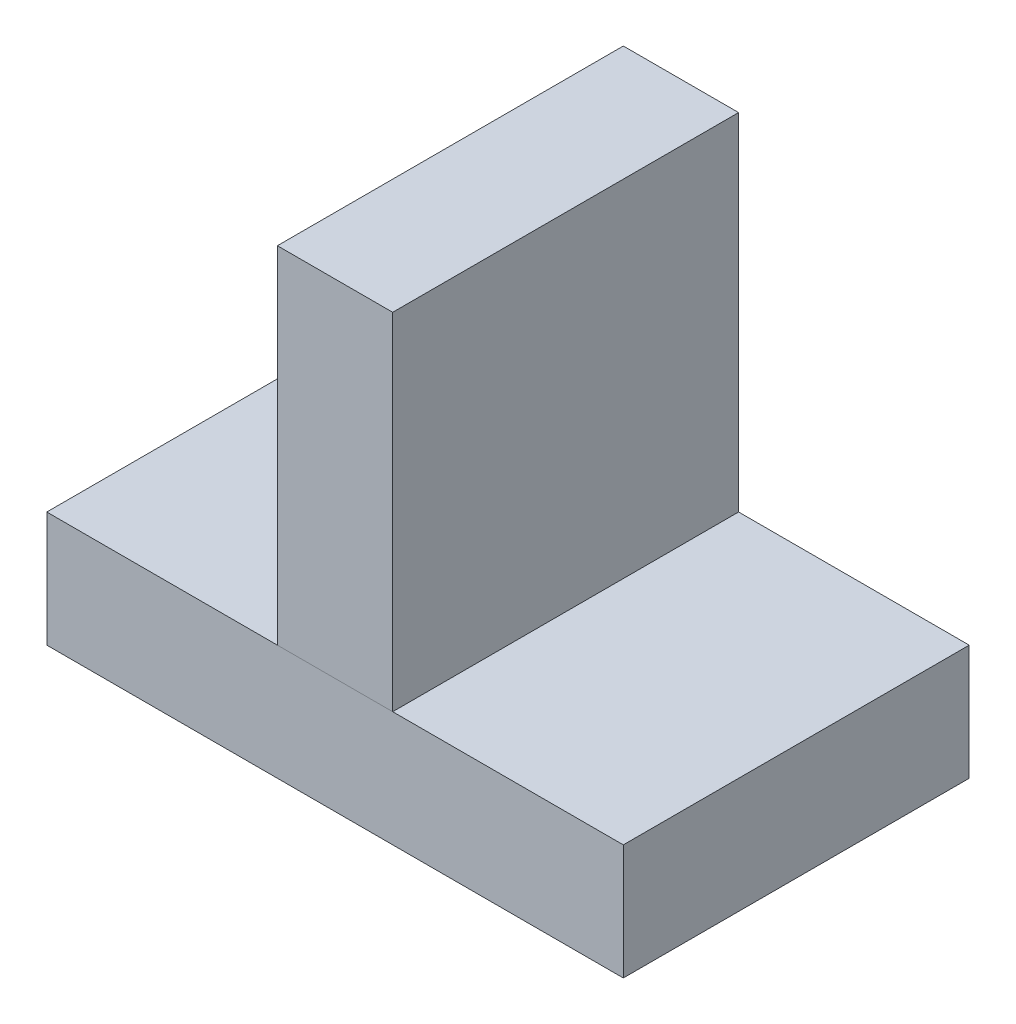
ISO-10303-21;
HEADER;
FILE_DESCRIPTION(('STEP AP214'),'2;1');
FILE_NAME('part.step','',(''),(''),'','','');
FILE_SCHEMA(('AUTOMOTIVE_DESIGN { 1 0 10303 214 1 1 1 1 }'));
ENDSEC;
DATA;
#1=APPLICATION_CONTEXT('core data for automotive mechanical design processes');
#2=APPLICATION_PROTOCOL_DEFINITION('international standard','automotive_design',2000,#1);
#3=PRODUCT_CONTEXT('',#1,'mechanical');
#4=PRODUCT('Part','Part','',(#3));
#5=PRODUCT_RELATED_PRODUCT_CATEGORY('part','',(#4));
#6=PRODUCT_DEFINITION_FORMATION('','',#4);
#7=PRODUCT_DEFINITION_CONTEXT('part definition',#1,'design');
#8=PRODUCT_DEFINITION('design','',#6,#7);
#9=PRODUCT_DEFINITION_SHAPE('','',#8);
#10=(LENGTH_UNIT() NAMED_UNIT(*) SI_UNIT(.MILLI.,.METRE.));
#11=(NAMED_UNIT(*) PLANE_ANGLE_UNIT() SI_UNIT($,.RADIAN.));
#12=(NAMED_UNIT(*) SI_UNIT($,.STERADIAN.) SOLID_ANGLE_UNIT());
#13=UNCERTAINTY_MEASURE_WITH_UNIT(LENGTH_MEASURE(1.E-05),#10,'distance_accuracy_value','');
#14=(GEOMETRIC_REPRESENTATION_CONTEXT(3) GLOBAL_UNCERTAINTY_ASSIGNED_CONTEXT((#13)) GLOBAL_UNIT_ASSIGNED_CONTEXT((#10,
#11,#12)) REPRESENTATION_CONTEXT('',''));
#15=CARTESIAN_POINT('',(0.,0.,0.));
#16=DIRECTION('',(0.,0.,1.));
#17=DIRECTION('',(1.,0.,0.));
#18=AXIS2_PLACEMENT_3D('',#15,#16,#17);
#19=CARTESIAN_POINT('',(-5.,40.,15.));
#20=DIRECTION('',(1.,0.,0.));
#21=DIRECTION('',(0.,1.,0.));
#22=AXIS2_PLACEMENT_3D('',#19,#20,#21);
#23=PLANE('',#22);
#24=DIRECTION('',(0.,-1.,0.));
#25=VECTOR('',#24,1.);
#26=CARTESIAN_POINT('',(-5.,40.,-15.));
#27=LINE('',#26,#25);
#28=CARTESIAN_POINT('',(-5.,40.,-15.));
#29=VERTEX_POINT('',#28);
#30=CARTESIAN_POINT('',(-5.,10.,-15.));
#31=VERTEX_POINT('',#30);
#32=EDGE_CURVE('E106',#29,#31,#27,.T.);
#33=ORIENTED_EDGE('',*,*,#32,.T.);
#34=DIRECTION('',(0.,0.,-1.));
#35=VECTOR('',#34,1.);
#36=CARTESIAN_POINT('',(-5.,10.,15.));
#37=LINE('',#36,#35);
#38=CARTESIAN_POINT('',(-5.,10.,15.));
#39=VERTEX_POINT('',#38);
#40=EDGE_CURVE('E12',#39,#31,#37,.T.);
#41=ORIENTED_EDGE('',*,*,#40,.F.);
#42=DIRECTION('',(0.,-1.,0.));
#43=VECTOR('',#42,1.);
#44=CARTESIAN_POINT('',(-5.,40.,15.));
#45=LINE('',#44,#43);
#46=CARTESIAN_POINT('',(-5.,40.,15.));
#47=VERTEX_POINT('',#46);
#48=EDGE_CURVE('E94',#47,#39,#45,.T.);
#49=ORIENTED_EDGE('',*,*,#48,.F.);
#50=DIRECTION('',(0.,0.,-1.));
#51=VECTOR('',#50,1.);
#52=CARTESIAN_POINT('',(-5.,40.,15.));
#53=LINE('',#52,#51);
#54=EDGE_CURVE('E102',#47,#29,#53,.T.);
#55=ORIENTED_EDGE('',*,*,#54,.T.);
#56=EDGE_LOOP('',(#33,#41,#49,#55));
#57=FACE_BOUND('',#56,.T.);
#58=ADVANCED_FACE('F43',(#57),#23,.F.);
#59=CARTESIAN_POINT('',(-5.,10.,15.));
#60=DIRECTION('',(0.,1.,0.));
#61=DIRECTION('',(0.,0.,1.));
#62=AXIS2_PLACEMENT_3D('',#59,#60,#61);
#63=PLANE('',#62);
#64=DIRECTION('',(1.,0.,0.));
#65=VECTOR('',#64,1.);
#66=CARTESIAN_POINT('',(-5.,10.,-15.));
#67=LINE('',#66,#65);
#68=CARTESIAN_POINT('',(5.,10.,-15.));
#69=VERTEX_POINT('',#68);
#70=EDGE_CURVE('E98',#31,#69,#67,.T.);
#71=ORIENTED_EDGE('',*,*,#70,.T.);
#72=DIRECTION('',(0.,0.,-1.));
#73=VECTOR('',#72,1.);
#74=CARTESIAN_POINT('',(5.,10.,15.));
#75=LINE('',#74,#73);
#76=CARTESIAN_POINT('',(5.,10.,15.));
#77=VERTEX_POINT('',#76);
#78=EDGE_CURVE('E51',#77,#69,#75,.T.);
#79=ORIENTED_EDGE('',*,*,#78,.F.);
#80=DIRECTION('',(1.,0.,0.));
#81=VECTOR('',#80,1.);
#82=CARTESIAN_POINT('',(-5.,10.,15.));
#83=LINE('',#82,#81);
#84=EDGE_CURVE('E89',#39,#77,#83,.T.);
#85=ORIENTED_EDGE('',*,*,#84,.F.);
#86=ORIENTED_EDGE('',*,*,#40,.T.);
#87=EDGE_LOOP('',(#71,#79,#85,#86));
#88=FACE_BOUND('',#87,.T.);
#89=ADVANCED_FACE('F97',(#88),#63,.F.);
#90=CARTESIAN_POINT('',(5.,40.,15.));
#91=DIRECTION('',(-1.,0.,0.));
#92=DIRECTION('',(0.,-1.,0.));
#93=AXIS2_PLACEMENT_3D('',#90,#91,#92);
#94=PLANE('',#93);
#95=DIRECTION('',(0.,1.,0.));
#96=VECTOR('',#95,1.);
#97=CARTESIAN_POINT('',(5.,40.,-15.));
#98=LINE('',#97,#96);
#99=CARTESIAN_POINT('',(5.,40.,-15.));
#100=VERTEX_POINT('',#99);
#101=EDGE_CURVE('E76',#69,#100,#98,.T.);
#102=ORIENTED_EDGE('',*,*,#101,.T.);
#103=DIRECTION('',(0.,0.,-1.));
#104=VECTOR('',#103,1.);
#105=CARTESIAN_POINT('',(5.,40.,15.));
#106=LINE('',#105,#104);
#107=CARTESIAN_POINT('',(5.,40.,15.));
#108=VERTEX_POINT('',#107);
#109=EDGE_CURVE('E99',#108,#100,#106,.T.);
#110=ORIENTED_EDGE('',*,*,#109,.F.);
#111=DIRECTION('',(0.,1.,0.));
#112=VECTOR('',#111,1.);
#113=CARTESIAN_POINT('',(5.,40.,15.));
#114=LINE('',#113,#112);
#115=EDGE_CURVE('E92',#77,#108,#114,.T.);
#116=ORIENTED_EDGE('',*,*,#115,.F.);
#117=ORIENTED_EDGE('',*,*,#78,.T.);
#118=EDGE_LOOP('',(#102,#110,#116,#117));
#119=FACE_BOUND('',#118,.T.);
#120=ADVANCED_FACE('F100',(#119),#94,.F.);
#121=CARTESIAN_POINT('',(-5.,40.,15.));
#122=DIRECTION('',(0.,-1.,0.));
#123=DIRECTION('',(0.,0.,-1.));
#124=AXIS2_PLACEMENT_3D('',#121,#122,#123);
#125=PLANE('',#124);
#126=DIRECTION('',(-1.,0.,0.));
#127=VECTOR('',#126,1.);
#128=CARTESIAN_POINT('',(-5.,40.,-15.));
#129=LINE('',#128,#127);
#130=EDGE_CURVE('E82',#100,#29,#129,.T.);
#131=ORIENTED_EDGE('',*,*,#130,.T.);
#132=ORIENTED_EDGE('',*,*,#54,.F.);
#133=DIRECTION('',(-1.,0.,0.));
#134=VECTOR('',#133,1.);
#135=CARTESIAN_POINT('',(-5.,40.,15.));
#136=LINE('',#135,#134);
#137=EDGE_CURVE('E59',#108,#47,#136,.T.);
#138=ORIENTED_EDGE('',*,*,#137,.F.);
#139=ORIENTED_EDGE('',*,*,#109,.T.);
#140=EDGE_LOOP('',(#131,#132,#138,#139));
#141=FACE_BOUND('',#140,.T.);
#142=ADVANCED_FACE('F113',(#141),#125,.F.);
#143=CARTESIAN_POINT('',(0.,0.,15.));
#144=DIRECTION('',(0.,0.,1.));
#145=DIRECTION('',(1.,0.,0.));
#146=AXIS2_PLACEMENT_3D('',#143,#144,#145);
#147=PLANE('',#146);
#148=ORIENTED_EDGE('',*,*,#48,.T.);
#149=ORIENTED_EDGE('',*,*,#84,.T.);
#150=ORIENTED_EDGE('',*,*,#115,.T.);
#151=ORIENTED_EDGE('',*,*,#137,.T.);
#152=EDGE_LOOP('',(#148,#149,#150,#151));
#153=FACE_BOUND('',#152,.T.);
#154=ADVANCED_FACE('F90',(#153),#147,.T.);
#155=CARTESIAN_POINT('',(0.,0.,-15.));
#156=DIRECTION('',(0.,0.,1.));
#157=DIRECTION('',(1.,0.,0.));
#158=AXIS2_PLACEMENT_3D('',#155,#156,#157);
#159=PLANE('',#158);
#160=ORIENTED_EDGE('',*,*,#32,.F.);
#161=ORIENTED_EDGE('',*,*,#130,.F.);
#162=ORIENTED_EDGE('',*,*,#101,.F.);
#163=ORIENTED_EDGE('',*,*,#70,.F.);
#164=EDGE_LOOP('',(#160,#161,#162,#163));
#165=FACE_BOUND('',#164,.T.);
#166=ADVANCED_FACE('F116',(#165),#159,.F.);
#167=CLOSED_SHELL('',(#58,#89,#120,#142,#154,#166));
#168=MANIFOLD_SOLID_BREP('B2',#167);
#169=CARTESIAN_POINT('',(25.,10.,15.));
#170=DIRECTION('',(-1.,0.,0.));
#171=DIRECTION('',(0.,0.,1.));
#172=AXIS2_PLACEMENT_3D('',#169,#170,#171);
#173=PLANE('',#172);
#174=DIRECTION('',(0.,0.,-1.));
#175=VECTOR('',#174,1.);
#176=CARTESIAN_POINT('',(25.,0.,15.));
#177=LINE('',#176,#175);
#178=CARTESIAN_POINT('',(25.,0.,15.));
#179=VERTEX_POINT('',#178);
#180=CARTESIAN_POINT('',(25.,0.,-15.));
#181=VERTEX_POINT('',#180);
#182=EDGE_CURVE('E230',#179,#181,#177,.T.);
#183=ORIENTED_EDGE('',*,*,#182,.T.);
#184=DIRECTION('',(0.,-1.,0.));
#185=VECTOR('',#184,1.);
#186=CARTESIAN_POINT('',(25.,10.,-15.));
#187=LINE('',#186,#185);
#188=CARTESIAN_POINT('',(25.,10.,-15.));
#189=VERTEX_POINT('',#188);
#190=EDGE_CURVE('E41',#189,#181,#187,.T.);
#191=ORIENTED_EDGE('',*,*,#190,.F.);
#192=DIRECTION('',(0.,0.,-1.));
#193=VECTOR('',#192,1.);
#194=CARTESIAN_POINT('',(25.,10.,15.));
#195=LINE('',#194,#193);
#196=CARTESIAN_POINT('',(25.,10.,15.));
#197=VERTEX_POINT('',#196);
#198=EDGE_CURVE('E218',#197,#189,#195,.T.);
#199=ORIENTED_EDGE('',*,*,#198,.F.);
#200=DIRECTION('',(0.,-1.,0.));
#201=VECTOR('',#200,1.);
#202=CARTESIAN_POINT('',(25.,10.,15.));
#203=LINE('',#202,#201);
#204=EDGE_CURVE('E226',#197,#179,#203,.T.);
#205=ORIENTED_EDGE('',*,*,#204,.T.);
#206=EDGE_LOOP('',(#183,#191,#199,#205));
#207=FACE_BOUND('',#206,.T.);
#208=ADVANCED_FACE('F167',(#207),#173,.F.);
#209=CARTESIAN_POINT('',(-25.,10.,-15.));
#210=DIRECTION('',(0.,0.,1.));
#211=DIRECTION('',(1.,0.,0.));
#212=AXIS2_PLACEMENT_3D('',#209,#210,#211);
#213=PLANE('',#212);
#214=DIRECTION('',(-1.,0.,0.));
#215=VECTOR('',#214,1.);
#216=CARTESIAN_POINT('',(-25.,0.,-15.));
#217=LINE('',#216,#215);
#218=CARTESIAN_POINT('',(-25.,0.,-15.));
#219=VERTEX_POINT('',#218);
#220=EDGE_CURVE('E222',#181,#219,#217,.T.);
#221=ORIENTED_EDGE('',*,*,#220,.T.);
#222=DIRECTION('',(0.,-1.,0.));
#223=VECTOR('',#222,1.);
#224=CARTESIAN_POINT('',(-25.,10.,-15.));
#225=LINE('',#224,#223);
#226=CARTESIAN_POINT('',(-25.,10.,-15.));
#227=VERTEX_POINT('',#226);
#228=EDGE_CURVE('E175',#227,#219,#225,.T.);
#229=ORIENTED_EDGE('',*,*,#228,.F.);
#230=DIRECTION('',(-1.,0.,0.));
#231=VECTOR('',#230,1.);
#232=CARTESIAN_POINT('',(-25.,10.,-15.));
#233=LINE('',#232,#231);
#234=EDGE_CURVE('E213',#189,#227,#233,.T.);
#235=ORIENTED_EDGE('',*,*,#234,.F.);
#236=ORIENTED_EDGE('',*,*,#190,.T.);
#237=EDGE_LOOP('',(#221,#229,#235,#236));
#238=FACE_BOUND('',#237,.T.);
#239=ADVANCED_FACE('F221',(#238),#213,.F.);
#240=CARTESIAN_POINT('',(-25.,10.,15.));
#241=DIRECTION('',(1.,0.,0.));
#242=DIRECTION('',(0.,0.,-1.));
#243=AXIS2_PLACEMENT_3D('',#240,#241,#242);
#244=PLANE('',#243);
#245=DIRECTION('',(0.,0.,1.));
#246=VECTOR('',#245,1.);
#247=CARTESIAN_POINT('',(-25.,0.,15.));
#248=LINE('',#247,#246);
#249=CARTESIAN_POINT('',(-25.,0.,15.));
#250=VERTEX_POINT('',#249);
#251=EDGE_CURVE('E200',#219,#250,#248,.T.);
#252=ORIENTED_EDGE('',*,*,#251,.T.);
#253=DIRECTION('',(0.,-1.,0.));
#254=VECTOR('',#253,1.);
#255=CARTESIAN_POINT('',(-25.,10.,15.));
#256=LINE('',#255,#254);
#257=CARTESIAN_POINT('',(-25.,10.,15.));
#258=VERTEX_POINT('',#257);
#259=EDGE_CURVE('E223',#258,#250,#256,.T.);
#260=ORIENTED_EDGE('',*,*,#259,.F.);
#261=DIRECTION('',(0.,0.,1.));
#262=VECTOR('',#261,1.);
#263=CARTESIAN_POINT('',(-25.,10.,15.));
#264=LINE('',#263,#262);
#265=EDGE_CURVE('E216',#227,#258,#264,.T.);
#266=ORIENTED_EDGE('',*,*,#265,.F.);
#267=ORIENTED_EDGE('',*,*,#228,.T.);
#268=EDGE_LOOP('',(#252,#260,#266,#267));
#269=FACE_BOUND('',#268,.T.);
#270=ADVANCED_FACE('F224',(#269),#244,.F.);
#271=CARTESIAN_POINT('',(-25.,10.,15.));
#272=DIRECTION('',(0.,0.,-1.));
#273=DIRECTION('',(-1.,0.,0.));
#274=AXIS2_PLACEMENT_3D('',#271,#272,#273);
#275=PLANE('',#274);
#276=DIRECTION('',(1.,0.,0.));
#277=VECTOR('',#276,1.);
#278=CARTESIAN_POINT('',(-25.,0.,15.));
#279=LINE('',#278,#277);
#280=EDGE_CURVE('E206',#250,#179,#279,.T.);
#281=ORIENTED_EDGE('',*,*,#280,.T.);
#282=ORIENTED_EDGE('',*,*,#204,.F.);
#283=DIRECTION('',(1.,0.,0.));
#284=VECTOR('',#283,1.);
#285=CARTESIAN_POINT('',(-25.,10.,15.));
#286=LINE('',#285,#284);
#287=EDGE_CURVE('E183',#258,#197,#286,.T.);
#288=ORIENTED_EDGE('',*,*,#287,.F.);
#289=ORIENTED_EDGE('',*,*,#259,.T.);
#290=EDGE_LOOP('',(#281,#282,#288,#289));
#291=FACE_BOUND('',#290,.T.);
#292=ADVANCED_FACE('F237',(#291),#275,.F.);
#293=CARTESIAN_POINT('',(0.,10.,0.));
#294=DIRECTION('',(0.,-1.,0.));
#295=DIRECTION('',(0.,0.,-1.));
#296=AXIS2_PLACEMENT_3D('',#293,#294,#295);
#297=PLANE('',#296);
#298=ORIENTED_EDGE('',*,*,#198,.T.);
#299=ORIENTED_EDGE('',*,*,#234,.T.);
#300=ORIENTED_EDGE('',*,*,#265,.T.);
#301=ORIENTED_EDGE('',*,*,#287,.T.);
#302=EDGE_LOOP('',(#298,#299,#300,#301));
#303=FACE_BOUND('',#302,.T.);
#304=ADVANCED_FACE('F214',(#303),#297,.F.);
#305=CARTESIAN_POINT('',(0.,0.,0.));
#306=DIRECTION('',(0.,-1.,0.));
#307=DIRECTION('',(0.,0.,-1.));
#308=AXIS2_PLACEMENT_3D('',#305,#306,#307);
#309=PLANE('',#308);
#310=ORIENTED_EDGE('',*,*,#182,.F.);
#311=ORIENTED_EDGE('',*,*,#280,.F.);
#312=ORIENTED_EDGE('',*,*,#251,.F.);
#313=ORIENTED_EDGE('',*,*,#220,.F.);
#314=EDGE_LOOP('',(#310,#311,#312,#313));
#315=FACE_BOUND('',#314,.T.);
#316=ADVANCED_FACE('F240',(#315),#309,.T.);
#317=CLOSED_SHELL('',(#208,#239,#270,#292,#304,#316));
#318=MANIFOLD_SOLID_BREP('B6',#317);
#319=ADVANCED_BREP_SHAPE_REPRESENTATION('',(#18,#168,#318),#14);
#320=SHAPE_DEFINITION_REPRESENTATION(#9,#319);
ENDSEC;
END-ISO-10303-21;
